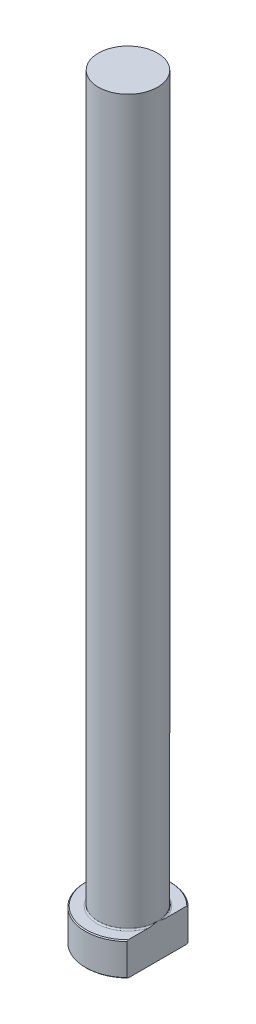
from build123d import *
from build123d.topology import SkipClean

# Parameters (mm, degrees)
CHAMFER1_SIZE = 0.2
FILLET1_R     = 0.3
KEY_DEPTH     = 161.505451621


with BuildPart() as part:
    # Sketch1 → Revolve1 (revolve)
    with BuildSketch(Plane.XY, mode=Mode.PRIVATE) as revolve1_sk:
        Polygon((0, 0), (-9, 0), (-9, 7), (-6.25, 7), (-6.25, 160), (0, 160), align=None)
    revolve(revolve1_sk.sketch.rotate(Axis((0, 259.958771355, 0), (0, -1, 0)), 270), axis=Axis((0, 259.958771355, 0), (0, -1, 0)))

    # Chamfer1
    chamfer1_edges = [part.edges().sort_by_distance(p)[0] for p in [
        (0, 7, -9),
        (0, 0, -9),
    ]]
    chamfer(chamfer1_edges, length=CHAMFER1_SIZE)

    # Fillet1
    fillet1_edges = [part.edges().sort_by_distance(p)[0] for p in [
        (0, 7, -6.25),
    ]]
    fillet(fillet1_edges, radius=FILLET1_R)

    # Sketch2 → KEY (cut, through all)
    with SkipClean():  # the faces are left unmerged after this step: merging them gives an invalid solid
        with BuildSketch(Plane(origin=(0, 0, 0), x_dir=(1, 0, 0), z_dir=(0, 1, 0))):
            with BuildLine():
                Line((6.25, 6.475916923), (6.25, -6.475916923))
                ThreePointArc((6.25, -6.475916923), (9, 0), (6.25, 6.475916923))
            make_face()
        extrude(amount=KEY_DEPTH, mode=Mode.SUBTRACT)


solid = part.part
